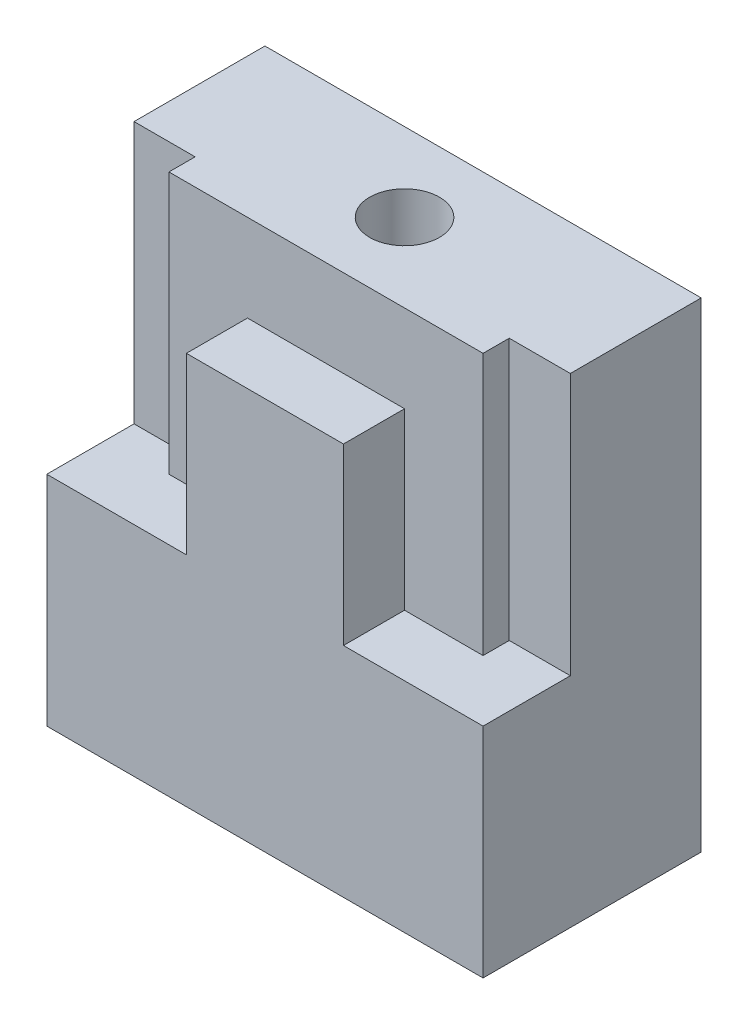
ISO-10303-21;
HEADER;
FILE_DESCRIPTION(('STEP AP214'),'2;1');
FILE_NAME('part.step','',(''),(''),'','','');
FILE_SCHEMA(('AUTOMOTIVE_DESIGN { 1 0 10303 214 1 1 1 1 }'));
ENDSEC;
DATA;
#1=APPLICATION_CONTEXT('core data for automotive mechanical design processes');
#2=APPLICATION_PROTOCOL_DEFINITION('international standard','automotive_design',2000,#1);
#3=PRODUCT_CONTEXT('',#1,'mechanical');
#4=PRODUCT('Part','Part','',(#3));
#5=PRODUCT_RELATED_PRODUCT_CATEGORY('part','',(#4));
#6=PRODUCT_DEFINITION_FORMATION('','',#4);
#7=PRODUCT_DEFINITION_CONTEXT('part definition',#1,'design');
#8=PRODUCT_DEFINITION('design','',#6,#7);
#9=PRODUCT_DEFINITION_SHAPE('','',#8);
#10=(LENGTH_UNIT() NAMED_UNIT(*) SI_UNIT(.MILLI.,.METRE.));
#11=(NAMED_UNIT(*) PLANE_ANGLE_UNIT() SI_UNIT($,.RADIAN.));
#12=(NAMED_UNIT(*) SI_UNIT($,.STERADIAN.) SOLID_ANGLE_UNIT());
#13=UNCERTAINTY_MEASURE_WITH_UNIT(LENGTH_MEASURE(1.E-05),#10,'distance_accuracy_value','');
#14=(GEOMETRIC_REPRESENTATION_CONTEXT(3) GLOBAL_UNCERTAINTY_ASSIGNED_CONTEXT((#13)) GLOBAL_UNIT_ASSIGNED_CONTEXT((#10,
#11,#12)) REPRESENTATION_CONTEXT('',''));
#15=CARTESIAN_POINT('',(0.,0.,0.));
#16=DIRECTION('',(0.,0.,1.));
#17=DIRECTION('',(1.,0.,0.));
#18=AXIS2_PLACEMENT_3D('',#15,#16,#17);
#19=CARTESIAN_POINT('',(-25.,55.,-12.5));
#20=DIRECTION('',(1.,0.,0.));
#21=DIRECTION('',(0.,0.,-1.));
#22=AXIS2_PLACEMENT_3D('',#19,#20,#21);
#23=PLANE('',#22);
#24=DIRECTION('',(0.,0.,1.));
#25=VECTOR('',#24,1.);
#26=CARTESIAN_POINT('',(-25.,25.,2.5));
#27=LINE('',#26,#25);
#28=CARTESIAN_POINT('',(-25.,25.,2.5));
#29=VERTEX_POINT('',#28);
#30=CARTESIAN_POINT('',(-25.,25.,12.5));
#31=VERTEX_POINT('',#30);
#32=EDGE_CURVE('E116',#29,#31,#27,.T.);
#33=ORIENTED_EDGE('',*,*,#32,.F.);
#34=DIRECTION('',(0.,1.,0.));
#35=VECTOR('',#34,1.);
#36=CARTESIAN_POINT('',(-25.,25.,2.5));
#37=LINE('',#36,#35);
#38=CARTESIAN_POINT('',(-25.,55.,2.5));
#39=VERTEX_POINT('',#38);
#40=EDGE_CURVE('E231',#29,#39,#37,.T.);
#41=ORIENTED_EDGE('',*,*,#40,.T.);
#42=DIRECTION('',(0.,0.,1.));
#43=VECTOR('',#42,1.);
#44=CARTESIAN_POINT('',(-25.,55.,-12.5));
#45=LINE('',#44,#43);
#46=CARTESIAN_POINT('',(-25.,55.,-12.5));
#47=VERTEX_POINT('',#46);
#48=EDGE_CURVE('E75',#47,#39,#45,.T.);
#49=ORIENTED_EDGE('',*,*,#48,.F.);
#50=DIRECTION('',(0.,-1.,0.));
#51=VECTOR('',#50,1.);
#52=CARTESIAN_POINT('',(-25.,55.,-12.5));
#53=LINE('',#52,#51);
#54=CARTESIAN_POINT('',(-25.,0.,-12.5));
#55=VERTEX_POINT('',#54);
#56=EDGE_CURVE('E70',#47,#55,#53,.T.);
#57=ORIENTED_EDGE('',*,*,#56,.T.);
#58=DIRECTION('',(0.,0.,1.));
#59=VECTOR('',#58,1.);
#60=CARTESIAN_POINT('',(-25.,0.,-12.5));
#61=LINE('',#60,#59);
#62=CARTESIAN_POINT('',(-25.,0.,12.5));
#63=VERTEX_POINT('',#62);
#64=EDGE_CURVE('E81',#55,#63,#61,.T.);
#65=ORIENTED_EDGE('',*,*,#64,.T.);
#66=DIRECTION('',(0.,-1.,0.));
#67=VECTOR('',#66,1.);
#68=CARTESIAN_POINT('',(-25.,55.,12.5));
#69=LINE('',#68,#67);
#70=EDGE_CURVE('E11',#31,#63,#69,.T.);
#71=ORIENTED_EDGE('',*,*,#70,.F.);
#72=EDGE_LOOP('',(#33,#41,#49,#57,#65,#71));
#73=FACE_BOUND('',#72,.T.);
#74=ADVANCED_FACE('F31',(#73),#23,.F.);
#75=CARTESIAN_POINT('',(-25.,55.,12.5));
#76=DIRECTION('',(0.,0.,-1.));
#77=DIRECTION('',(-1.,0.,0.));
#78=AXIS2_PLACEMENT_3D('',#75,#76,#77);
#79=PLANE('',#78);
#80=DIRECTION('',(1.,0.,0.));
#81=VECTOR('',#80,1.);
#82=CARTESIAN_POINT('',(25.,25.,12.5));
#83=LINE('',#82,#81);
#84=CARTESIAN_POINT('',(9.,25.,12.5));
#85=VERTEX_POINT('',#84);
#86=CARTESIAN_POINT('',(25.,25.,12.5));
#87=VERTEX_POINT('',#86);
#88=EDGE_CURVE('E256',#85,#87,#83,.T.);
#89=ORIENTED_EDGE('',*,*,#88,.F.);
#90=DIRECTION('',(0.,1.,0.));
#91=VECTOR('',#90,1.);
#92=CARTESIAN_POINT('',(9.,25.,12.5));
#93=LINE('',#92,#91);
#94=CARTESIAN_POINT('',(9.,45.,12.5));
#95=VERTEX_POINT('',#94);
#96=EDGE_CURVE('E162',#85,#95,#93,.T.);
#97=ORIENTED_EDGE('',*,*,#96,.T.);
#98=DIRECTION('',(1.,0.,0.));
#99=VECTOR('',#98,1.);
#100=CARTESIAN_POINT('',(-9.,45.,12.5));
#101=LINE('',#100,#99);
#102=CARTESIAN_POINT('',(-9.,45.,12.5));
#103=VERTEX_POINT('',#102);
#104=EDGE_CURVE('E172',#103,#95,#101,.T.);
#105=ORIENTED_EDGE('',*,*,#104,.F.);
#106=DIRECTION('',(0.,1.,0.));
#107=VECTOR('',#106,1.);
#108=CARTESIAN_POINT('',(-9.,25.,12.5));
#109=LINE('',#108,#107);
#110=CARTESIAN_POINT('',(-9.,25.,12.5));
#111=VERTEX_POINT('',#110);
#112=EDGE_CURVE('E186',#111,#103,#109,.T.);
#113=ORIENTED_EDGE('',*,*,#112,.F.);
#114=DIRECTION('',(1.,0.,0.));
#115=VECTOR('',#114,1.);
#116=CARTESIAN_POINT('',(-25.,25.,12.5));
#117=LINE('',#116,#115);
#118=EDGE_CURVE('E113',#31,#111,#117,.T.);
#119=ORIENTED_EDGE('',*,*,#118,.F.);
#120=ORIENTED_EDGE('',*,*,#70,.T.);
#121=DIRECTION('',(1.,0.,0.));
#122=VECTOR('',#121,1.);
#123=CARTESIAN_POINT('',(-25.,0.,12.5));
#124=LINE('',#123,#122);
#125=CARTESIAN_POINT('',(25.,0.,12.5));
#126=VERTEX_POINT('',#125);
#127=EDGE_CURVE('E87',#63,#126,#124,.T.);
#128=ORIENTED_EDGE('',*,*,#127,.T.);
#129=DIRECTION('',(0.,-1.,0.));
#130=VECTOR('',#129,1.);
#131=CARTESIAN_POINT('',(25.,55.,12.5));
#132=LINE('',#131,#130);
#133=EDGE_CURVE('E39',#87,#126,#132,.T.);
#134=ORIENTED_EDGE('',*,*,#133,.F.);
#135=EDGE_LOOP('',(#89,#97,#105,#113,#119,#120,#128,#134));
#136=FACE_BOUND('',#135,.T.);
#137=ADVANCED_FACE('F108',(#136),#79,.F.);
#138=CARTESIAN_POINT('',(25.,55.,-12.5));
#139=DIRECTION('',(-1.,0.,0.));
#140=DIRECTION('',(0.,0.,1.));
#141=AXIS2_PLACEMENT_3D('',#138,#139,#140);
#142=PLANE('',#141);
#143=DIRECTION('',(0.,0.,-1.));
#144=VECTOR('',#143,1.);
#145=CARTESIAN_POINT('',(25.,55.,-12.5));
#146=LINE('',#145,#144);
#147=CARTESIAN_POINT('',(25.,55.,2.5));
#148=VERTEX_POINT('',#147);
#149=CARTESIAN_POINT('',(25.,55.,-12.5));
#150=VERTEX_POINT('',#149);
#151=EDGE_CURVE('E188',#148,#150,#146,.T.);
#152=ORIENTED_EDGE('',*,*,#151,.F.);
#153=DIRECTION('',(0.,1.,0.));
#154=VECTOR('',#153,1.);
#155=CARTESIAN_POINT('',(25.,25.,2.5));
#156=LINE('',#155,#154);
#157=CARTESIAN_POINT('',(25.,25.,2.5));
#158=VERTEX_POINT('',#157);
#159=EDGE_CURVE('E199',#158,#148,#156,.T.);
#160=ORIENTED_EDGE('',*,*,#159,.F.);
#161=DIRECTION('',(0.,0.,-1.));
#162=VECTOR('',#161,1.);
#163=CARTESIAN_POINT('',(25.,25.,2.5));
#164=LINE('',#163,#162);
#165=EDGE_CURVE('E105',#87,#158,#164,.T.);
#166=ORIENTED_EDGE('',*,*,#165,.F.);
#167=ORIENTED_EDGE('',*,*,#133,.T.);
#168=DIRECTION('',(0.,0.,-1.));
#169=VECTOR('',#168,1.);
#170=CARTESIAN_POINT('',(25.,0.,-12.5));
#171=LINE('',#170,#169);
#172=CARTESIAN_POINT('',(25.,0.,-12.5));
#173=VERTEX_POINT('',#172);
#174=EDGE_CURVE('E62',#126,#173,#171,.T.);
#175=ORIENTED_EDGE('',*,*,#174,.T.);
#176=DIRECTION('',(0.,-1.,0.));
#177=VECTOR('',#176,1.);
#178=CARTESIAN_POINT('',(25.,55.,-12.5));
#179=LINE('',#178,#177);
#180=EDGE_CURVE('E72',#150,#173,#179,.T.);
#181=ORIENTED_EDGE('',*,*,#180,.F.);
#182=EDGE_LOOP('',(#152,#160,#166,#167,#175,#181));
#183=FACE_BOUND('',#182,.T.);
#184=ADVANCED_FACE('F101',(#183),#142,.F.);
#185=CARTESIAN_POINT('',(-25.,55.,-12.5));
#186=DIRECTION('',(0.,0.,1.));
#187=DIRECTION('',(1.,0.,0.));
#188=AXIS2_PLACEMENT_3D('',#185,#186,#187);
#189=PLANE('',#188);
#190=DIRECTION('',(-1.,0.,0.));
#191=VECTOR('',#190,1.);
#192=CARTESIAN_POINT('',(-25.,0.,-12.5));
#193=LINE('',#192,#191);
#194=EDGE_CURVE('E67',#173,#55,#193,.T.);
#195=ORIENTED_EDGE('',*,*,#194,.T.);
#196=ORIENTED_EDGE('',*,*,#56,.F.);
#197=DIRECTION('',(-1.,0.,0.));
#198=VECTOR('',#197,1.);
#199=CARTESIAN_POINT('',(-25.,55.,-12.5));
#200=LINE('',#199,#198);
#201=EDGE_CURVE('E47',#150,#47,#200,.T.);
#202=ORIENTED_EDGE('',*,*,#201,.F.);
#203=ORIENTED_EDGE('',*,*,#180,.T.);
#204=EDGE_LOOP('',(#195,#196,#202,#203));
#205=FACE_BOUND('',#204,.T.);
#206=ADVANCED_FACE('F69',(#205),#189,.F.);
#207=CARTESIAN_POINT('',(-25.,55.,12.5));
#208=DIRECTION('',(0.,1.,0.));
#209=DIRECTION('',(0.,0.,1.));
#210=AXIS2_PLACEMENT_3D('',#207,#208,#209);
#211=PLANE('',#210);
#212=DIRECTION('',(-1.,0.,0.));
#213=VECTOR('',#212,1.);
#214=CARTESIAN_POINT('',(-9.,55.,5.5));
#215=LINE('',#214,#213);
#216=CARTESIAN_POINT('',(18.,55.,5.5));
#217=VERTEX_POINT('',#216);
#218=CARTESIAN_POINT('',(-18.,55.,5.5));
#219=VERTEX_POINT('',#218);
#220=EDGE_CURVE('E184',#217,#219,#215,.T.);
#221=ORIENTED_EDGE('',*,*,#220,.F.);
#222=DIRECTION('',(0.,0.,1.));
#223=VECTOR('',#222,1.);
#224=CARTESIAN_POINT('',(18.,55.,5.5));
#225=LINE('',#224,#223);
#226=CARTESIAN_POINT('',(18.,55.,2.5));
#227=VERTEX_POINT('',#226);
#228=EDGE_CURVE('E259',#227,#217,#225,.T.);
#229=ORIENTED_EDGE('',*,*,#228,.F.);
#230=DIRECTION('',(-1.,0.,0.));
#231=VECTOR('',#230,1.);
#232=CARTESIAN_POINT('',(18.,55.,2.5));
#233=LINE('',#232,#231);
#234=EDGE_CURVE('E196',#148,#227,#233,.T.);
#235=ORIENTED_EDGE('',*,*,#234,.F.);
#236=ORIENTED_EDGE('',*,*,#151,.T.);
#237=ORIENTED_EDGE('',*,*,#201,.T.);
#238=ORIENTED_EDGE('',*,*,#48,.T.);
#239=DIRECTION('',(-1.,0.,0.));
#240=VECTOR('',#239,1.);
#241=CARTESIAN_POINT('',(-18.,55.,2.5));
#242=LINE('',#241,#240);
#243=CARTESIAN_POINT('',(-18.,55.,2.5));
#244=VERTEX_POINT('',#243);
#245=EDGE_CURVE('E248',#244,#39,#242,.T.);
#246=ORIENTED_EDGE('',*,*,#245,.F.);
#247=DIRECTION('',(0.,0.,-1.));
#248=VECTOR('',#247,1.);
#249=CARTESIAN_POINT('',(-18.,55.,5.5));
#250=LINE('',#249,#248);
#251=EDGE_CURVE('E228',#219,#244,#250,.T.);
#252=ORIENTED_EDGE('',*,*,#251,.F.);
#253=EDGE_LOOP('',(#221,#229,#235,#236,#237,#238,#246,#252));
#254=FACE_BOUND('',#253,.T.);
#255=CARTESIAN_POINT('',(0.,55.,-3.5));
#256=DIRECTION('',(0.,1.,0.));
#257=DIRECTION('',(0.,0.,1.));
#258=AXIS2_PLACEMENT_3D('',#255,#256,#257);
#259=CIRCLE('',#258,4.);
#260=CARTESIAN_POINT('',(0.,55.,0.499999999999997));
#261=VERTEX_POINT('',#260);
#262=EDGE_CURVE('E92',#261,#261,#259,.T.);
#263=ORIENTED_EDGE('',*,*,#262,.F.);
#264=EDGE_LOOP('',(#263));
#265=FACE_BOUND('',#264,.T.);
#266=ADVANCED_FACE('F191',(#254,#265),#211,.T.);
#267=CARTESIAN_POINT('',(-25.,0.,12.5));
#268=DIRECTION('',(0.,1.,0.));
#269=DIRECTION('',(0.,0.,1.));
#270=AXIS2_PLACEMENT_3D('',#267,#268,#269);
#271=PLANE('',#270);
#272=CARTESIAN_POINT('',(0.,0.,-3.5));
#273=DIRECTION('',(0.,1.,0.));
#274=DIRECTION('',(0.,0.,1.));
#275=AXIS2_PLACEMENT_3D('',#272,#273,#274);
#276=CIRCLE('',#275,4.);
#277=CARTESIAN_POINT('',(0.,0.,0.499999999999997));
#278=VERTEX_POINT('',#277);
#279=EDGE_CURVE('E88',#278,#278,#276,.T.);
#280=ORIENTED_EDGE('',*,*,#279,.T.);
#281=EDGE_LOOP('',(#280));
#282=FACE_BOUND('',#281,.T.);
#283=ORIENTED_EDGE('',*,*,#64,.F.);
#284=ORIENTED_EDGE('',*,*,#194,.F.);
#285=ORIENTED_EDGE('',*,*,#174,.F.);
#286=ORIENTED_EDGE('',*,*,#127,.F.);
#287=EDGE_LOOP('',(#283,#284,#285,#286));
#288=FACE_BOUND('',#287,.T.);
#289=ADVANCED_FACE('F85',(#282,#288),#271,.F.);
#290=CARTESIAN_POINT('',(0.,0.,-3.5));
#291=DIRECTION('',(0.,1.,0.));
#292=DIRECTION('',(0.,0.,1.));
#293=AXIS2_PLACEMENT_3D('',#290,#291,#292);
#294=CYLINDRICAL_SURFACE('',#293,4.);
#295=ORIENTED_EDGE('',*,*,#279,.F.);
#296=EDGE_LOOP('',(#295));
#297=FACE_BOUND('',#296,.T.);
#298=ORIENTED_EDGE('',*,*,#262,.T.);
#299=EDGE_LOOP('',(#298));
#300=FACE_BOUND('',#299,.T.);
#301=ADVANCED_FACE('F315',(#297,#300),#294,.F.);
#302=CARTESIAN_POINT('',(-9.,45.,5.5));
#303=DIRECTION('',(0.,0.,-1.));
#304=DIRECTION('',(-1.,0.,0.));
#305=AXIS2_PLACEMENT_3D('',#302,#303,#304);
#306=PLANE('',#305);
#307=ORIENTED_EDGE('',*,*,#220,.T.);
#308=DIRECTION('',(0.,1.,0.));
#309=VECTOR('',#308,1.);
#310=CARTESIAN_POINT('',(-18.,25.,5.5));
#311=LINE('',#310,#309);
#312=CARTESIAN_POINT('',(-18.,25.,5.5));
#313=VERTEX_POINT('',#312);
#314=EDGE_CURVE('E232',#313,#219,#311,.T.);
#315=ORIENTED_EDGE('',*,*,#314,.F.);
#316=DIRECTION('',(-1.,0.,0.));
#317=VECTOR('',#316,1.);
#318=CARTESIAN_POINT('',(-9.,25.,5.5));
#319=LINE('',#318,#317);
#320=CARTESIAN_POINT('',(-9.,25.,5.5));
#321=VERTEX_POINT('',#320);
#322=EDGE_CURVE('E239',#321,#313,#319,.T.);
#323=ORIENTED_EDGE('',*,*,#322,.F.);
#324=DIRECTION('',(0.,1.,0.));
#325=VECTOR('',#324,1.);
#326=CARTESIAN_POINT('',(-9.,25.,5.5));
#327=LINE('',#326,#325);
#328=CARTESIAN_POINT('',(-9.,45.,5.5));
#329=VERTEX_POINT('',#328);
#330=EDGE_CURVE('E178',#321,#329,#327,.T.);
#331=ORIENTED_EDGE('',*,*,#330,.T.);
#332=DIRECTION('',(-1.,0.,0.));
#333=VECTOR('',#332,1.);
#334=CARTESIAN_POINT('',(-9.,45.,5.5));
#335=LINE('',#334,#333);
#336=CARTESIAN_POINT('',(9.,45.,5.49999999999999));
#337=VERTEX_POINT('',#336);
#338=EDGE_CURVE('E170',#337,#329,#335,.T.);
#339=ORIENTED_EDGE('',*,*,#338,.F.);
#340=DIRECTION('',(0.,1.,0.));
#341=VECTOR('',#340,1.);
#342=CARTESIAN_POINT('',(9.,25.,5.5));
#343=LINE('',#342,#341);
#344=CARTESIAN_POINT('',(9.,25.,5.5));
#345=VERTEX_POINT('',#344);
#346=EDGE_CURVE('E149',#345,#337,#343,.T.);
#347=ORIENTED_EDGE('',*,*,#346,.F.);
#348=DIRECTION('',(-1.,0.,0.));
#349=VECTOR('',#348,1.);
#350=CARTESIAN_POINT('',(9.,25.,5.5));
#351=LINE('',#350,#349);
#352=CARTESIAN_POINT('',(18.,25.,5.5));
#353=VERTEX_POINT('',#352);
#354=EDGE_CURVE('E270',#353,#345,#351,.T.);
#355=ORIENTED_EDGE('',*,*,#354,.F.);
#356=DIRECTION('',(0.,1.,0.));
#357=VECTOR('',#356,1.);
#358=CARTESIAN_POINT('',(18.,25.,5.5));
#359=LINE('',#358,#357);
#360=EDGE_CURVE('E163',#353,#217,#359,.T.);
#361=ORIENTED_EDGE('',*,*,#360,.T.);
#362=EDGE_LOOP('',(#307,#315,#323,#331,#339,#347,#355,#361));
#363=FACE_BOUND('',#362,.T.);
#364=ADVANCED_FACE('F175',(#363),#306,.F.);
#365=CARTESIAN_POINT('',(-9.,45.,12.5));
#366=DIRECTION('',(0.,1.,0.));
#367=DIRECTION('',(0.,0.,1.));
#368=AXIS2_PLACEMENT_3D('',#365,#366,#367);
#369=PLANE('',#368);
#370=DIRECTION('',(0.,0.,1.));
#371=VECTOR('',#370,1.);
#372=CARTESIAN_POINT('',(-9.,45.,5.5));
#373=LINE('',#372,#371);
#374=EDGE_CURVE('E185',#329,#103,#373,.T.);
#375=ORIENTED_EDGE('',*,*,#374,.T.);
#376=ORIENTED_EDGE('',*,*,#104,.T.);
#377=DIRECTION('',(0.,0.,-1.));
#378=VECTOR('',#377,1.);
#379=CARTESIAN_POINT('',(9.,45.,5.49999999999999));
#380=LINE('',#379,#378);
#381=EDGE_CURVE('E153',#95,#337,#380,.T.);
#382=ORIENTED_EDGE('',*,*,#381,.T.);
#383=ORIENTED_EDGE('',*,*,#338,.T.);
#384=EDGE_LOOP('',(#375,#376,#382,#383));
#385=FACE_BOUND('',#384,.T.);
#386=ADVANCED_FACE('F169',(#385),#369,.T.);
#387=CARTESIAN_POINT('',(-9.,25.,12.5));
#388=DIRECTION('',(1.,0.,0.));
#389=DIRECTION('',(0.,0.,-1.));
#390=AXIS2_PLACEMENT_3D('',#387,#388,#389);
#391=PLANE('',#390);
#392=ORIENTED_EDGE('',*,*,#374,.F.);
#393=ORIENTED_EDGE('',*,*,#330,.F.);
#394=DIRECTION('',(0.,0.,-1.));
#395=VECTOR('',#394,1.);
#396=CARTESIAN_POINT('',(-9.,25.,12.5));
#397=LINE('',#396,#395);
#398=EDGE_CURVE('E241',#111,#321,#397,.T.);
#399=ORIENTED_EDGE('',*,*,#398,.F.);
#400=ORIENTED_EDGE('',*,*,#112,.T.);
#401=EDGE_LOOP('',(#392,#393,#399,#400));
#402=FACE_BOUND('',#401,.T.);
#403=ADVANCED_FACE('F266',(#402),#391,.F.);
#404=CARTESIAN_POINT('',(-18.,25.,2.5));
#405=DIRECTION('',(0.,0.,-1.));
#406=DIRECTION('',(-1.,0.,0.));
#407=AXIS2_PLACEMENT_3D('',#404,#405,#406);
#408=PLANE('',#407);
#409=ORIENTED_EDGE('',*,*,#245,.T.);
#410=ORIENTED_EDGE('',*,*,#40,.F.);
#411=DIRECTION('',(-1.,0.,0.));
#412=VECTOR('',#411,1.);
#413=CARTESIAN_POINT('',(-18.,25.,2.5));
#414=LINE('',#413,#412);
#415=CARTESIAN_POINT('',(-18.,25.,2.5));
#416=VERTEX_POINT('',#415);
#417=EDGE_CURVE('E234',#416,#29,#414,.T.);
#418=ORIENTED_EDGE('',*,*,#417,.F.);
#419=DIRECTION('',(0.,1.,0.));
#420=VECTOR('',#419,1.);
#421=CARTESIAN_POINT('',(-18.,25.,2.5));
#422=LINE('',#421,#420);
#423=EDGE_CURVE('E220',#416,#244,#422,.T.);
#424=ORIENTED_EDGE('',*,*,#423,.T.);
#425=EDGE_LOOP('',(#409,#410,#418,#424));
#426=FACE_BOUND('',#425,.T.);
#427=ADVANCED_FACE('F235',(#426),#408,.F.);
#428=CARTESIAN_POINT('',(-18.,25.,5.5));
#429=DIRECTION('',(1.,0.,0.));
#430=DIRECTION('',(0.,0.,-1.));
#431=AXIS2_PLACEMENT_3D('',#428,#429,#430);
#432=PLANE('',#431);
#433=ORIENTED_EDGE('',*,*,#251,.T.);
#434=ORIENTED_EDGE('',*,*,#423,.F.);
#435=DIRECTION('',(0.,0.,-1.));
#436=VECTOR('',#435,1.);
#437=CARTESIAN_POINT('',(-18.,25.,5.5));
#438=LINE('',#437,#436);
#439=EDGE_CURVE('E225',#313,#416,#438,.T.);
#440=ORIENTED_EDGE('',*,*,#439,.F.);
#441=ORIENTED_EDGE('',*,*,#314,.T.);
#442=EDGE_LOOP('',(#433,#434,#440,#441));
#443=FACE_BOUND('',#442,.T.);
#444=ADVANCED_FACE('F222',(#443),#432,.F.);
#445=CARTESIAN_POINT('',(-9.,25.,12.5));
#446=DIRECTION('',(0.,-1.,0.));
#447=DIRECTION('',(0.,0.,-1.));
#448=AXIS2_PLACEMENT_3D('',#445,#446,#447);
#449=PLANE('',#448);
#450=ORIENTED_EDGE('',*,*,#398,.T.);
#451=ORIENTED_EDGE('',*,*,#322,.T.);
#452=ORIENTED_EDGE('',*,*,#439,.T.);
#453=ORIENTED_EDGE('',*,*,#417,.T.);
#454=ORIENTED_EDGE('',*,*,#32,.T.);
#455=ORIENTED_EDGE('',*,*,#118,.T.);
#456=EDGE_LOOP('',(#450,#451,#452,#453,#454,#455));
#457=FACE_BOUND('',#456,.T.);
#458=ADVANCED_FACE('F238',(#457),#449,.F.);
#459=CARTESIAN_POINT('',(9.,25.,12.5));
#460=DIRECTION('',(-1.,0.,0.));
#461=DIRECTION('',(0.,0.,1.));
#462=AXIS2_PLACEMENT_3D('',#459,#460,#461);
#463=PLANE('',#462);
#464=ORIENTED_EDGE('',*,*,#381,.F.);
#465=ORIENTED_EDGE('',*,*,#96,.F.);
#466=DIRECTION('',(0.,0.,1.));
#467=VECTOR('',#466,1.);
#468=CARTESIAN_POINT('',(9.,25.,12.5));
#469=LINE('',#468,#467);
#470=EDGE_CURVE('E157',#345,#85,#469,.T.);
#471=ORIENTED_EDGE('',*,*,#470,.F.);
#472=ORIENTED_EDGE('',*,*,#346,.T.);
#473=EDGE_LOOP('',(#464,#465,#471,#472));
#474=FACE_BOUND('',#473,.T.);
#475=ADVANCED_FACE('F151',(#474),#463,.F.);
#476=CARTESIAN_POINT('',(18.,25.,5.5));
#477=DIRECTION('',(-1.,0.,0.));
#478=DIRECTION('',(0.,0.,1.));
#479=AXIS2_PLACEMENT_3D('',#476,#477,#478);
#480=PLANE('',#479);
#481=ORIENTED_EDGE('',*,*,#228,.T.);
#482=ORIENTED_EDGE('',*,*,#360,.F.);
#483=DIRECTION('',(0.,0.,1.));
#484=VECTOR('',#483,1.);
#485=CARTESIAN_POINT('',(18.,25.,5.5));
#486=LINE('',#485,#484);
#487=CARTESIAN_POINT('',(18.,25.,2.5));
#488=VERTEX_POINT('',#487);
#489=EDGE_CURVE('E280',#488,#353,#486,.T.);
#490=ORIENTED_EDGE('',*,*,#489,.F.);
#491=DIRECTION('',(0.,1.,0.));
#492=VECTOR('',#491,1.);
#493=CARTESIAN_POINT('',(18.,25.,2.5));
#494=LINE('',#493,#492);
#495=EDGE_CURVE('E264',#488,#227,#494,.T.);
#496=ORIENTED_EDGE('',*,*,#495,.T.);
#497=EDGE_LOOP('',(#481,#482,#490,#496));
#498=FACE_BOUND('',#497,.T.);
#499=ADVANCED_FACE('F274',(#498),#480,.F.);
#500=CARTESIAN_POINT('',(18.,25.,2.5));
#501=DIRECTION('',(0.,0.,-1.));
#502=DIRECTION('',(-1.,0.,0.));
#503=AXIS2_PLACEMENT_3D('',#500,#501,#502);
#504=PLANE('',#503);
#505=ORIENTED_EDGE('',*,*,#234,.T.);
#506=ORIENTED_EDGE('',*,*,#495,.F.);
#507=DIRECTION('',(-1.,0.,0.));
#508=VECTOR('',#507,1.);
#509=CARTESIAN_POINT('',(18.,25.,2.5));
#510=LINE('',#509,#508);
#511=EDGE_CURVE('E282',#158,#488,#510,.T.);
#512=ORIENTED_EDGE('',*,*,#511,.F.);
#513=ORIENTED_EDGE('',*,*,#159,.T.);
#514=EDGE_LOOP('',(#505,#506,#512,#513));
#515=FACE_BOUND('',#514,.T.);
#516=ADVANCED_FACE('F292',(#515),#504,.F.);
#517=CARTESIAN_POINT('',(9.,25.,12.5));
#518=DIRECTION('',(0.,-1.,0.));
#519=DIRECTION('',(0.,0.,-1.));
#520=AXIS2_PLACEMENT_3D('',#517,#518,#519);
#521=PLANE('',#520);
#522=ORIENTED_EDGE('',*,*,#88,.T.);
#523=ORIENTED_EDGE('',*,*,#165,.T.);
#524=ORIENTED_EDGE('',*,*,#511,.T.);
#525=ORIENTED_EDGE('',*,*,#489,.T.);
#526=ORIENTED_EDGE('',*,*,#354,.T.);
#527=ORIENTED_EDGE('',*,*,#470,.T.);
#528=EDGE_LOOP('',(#522,#523,#524,#525,#526,#527));
#529=FACE_BOUND('',#528,.T.);
#530=ADVANCED_FACE('F286',(#529),#521,.F.);
#531=CLOSED_SHELL('',(#74,#137,#184,#206,#266,#289,#301,#364,#386,#403,#427,#444,#458,#475,#499,
#516,#530));
#532=MANIFOLD_SOLID_BREP('B2',#531);
#533=ADVANCED_BREP_SHAPE_REPRESENTATION('',(#18,#532),#14);
#534=SHAPE_DEFINITION_REPRESENTATION(#9,#533);
ENDSEC;
END-ISO-10303-21;
